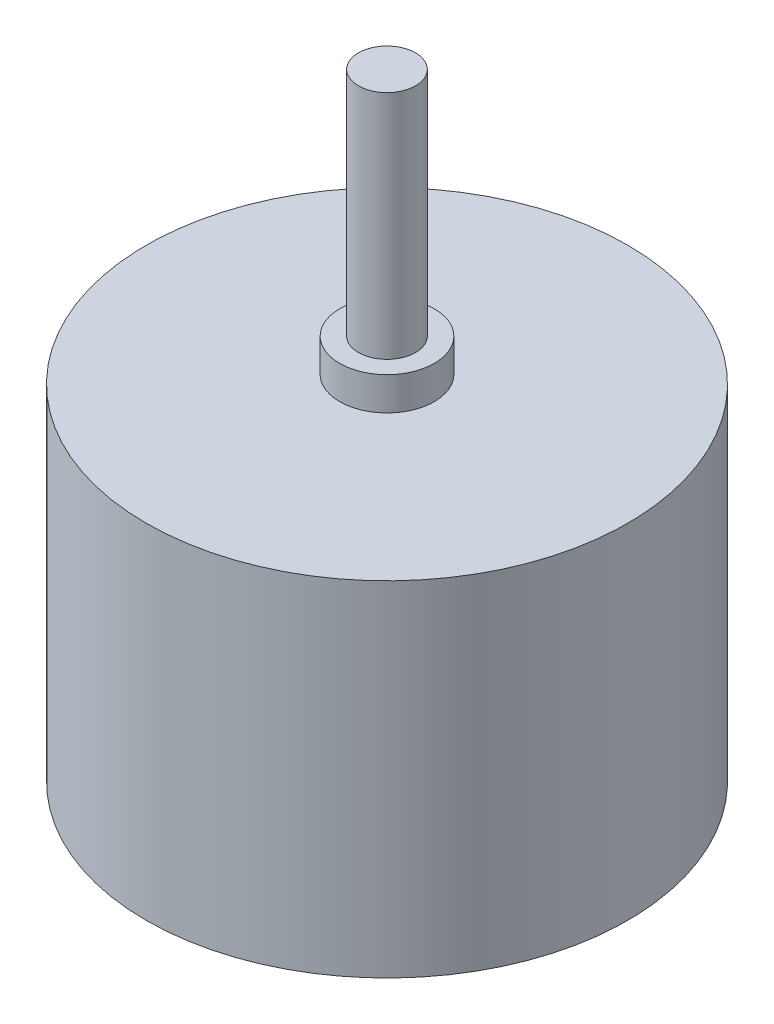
from build123d import *


with BuildPart() as part:
    # Sketch1 → Revolve1 (revolve)
    with BuildSketch(Plane.XY, mode=Mode.PRIVATE) as revolve1_sk:
        Polygon((4.9657, 38.1), (44.45, 38.1), (44.45, -25.4), (6.110940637, -25.4), (5.55625, -26.924), (5.55625, -44.45), (0, -44.45), (0, 88.4428), (5.2705, 88.4428), (5.2705, 45.7962), (8.73125, 45.7962), (8.73125, 39.6748), (4.9657, 39.6748), align=None)
    revolve(revolve1_sk.sketch.rotate(Axis((0, 1.203768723, 0), (0, -1, 0)), 90), axis=Axis((0, 1.203768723, 0), (0, -1, 0)))


solid = part.part
